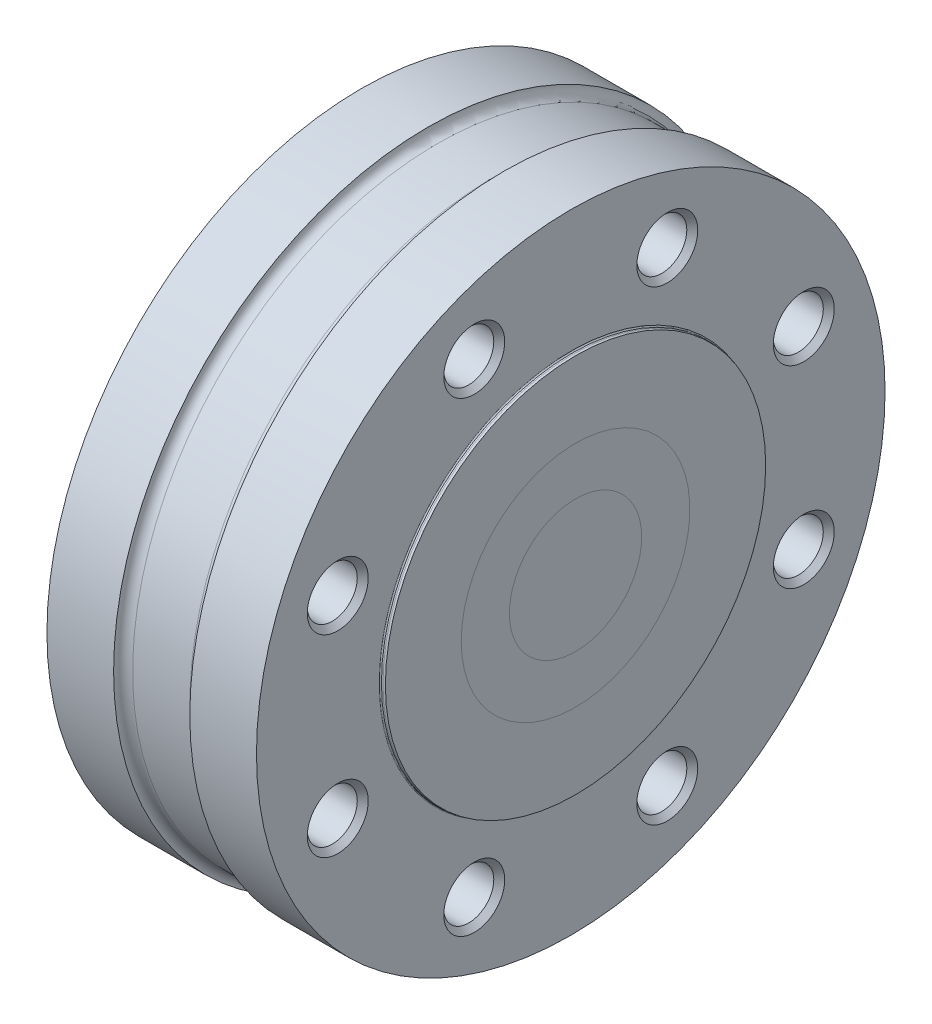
ISO-10303-21;
HEADER;
FILE_DESCRIPTION(('STEP AP214'),'2;1');
FILE_NAME('part.step','',(''),(''),'','','');
FILE_SCHEMA(('AUTOMOTIVE_DESIGN { 1 0 10303 214 1 1 1 1 }'));
ENDSEC;
DATA;
#1=APPLICATION_CONTEXT('core data for automotive mechanical design processes');
#2=APPLICATION_PROTOCOL_DEFINITION('international standard','automotive_design',2000,#1);
#3=PRODUCT_CONTEXT('',#1,'mechanical');
#4=PRODUCT('Part','Part','',(#3));
#5=PRODUCT_RELATED_PRODUCT_CATEGORY('part','',(#4));
#6=PRODUCT_DEFINITION_FORMATION('','',#4);
#7=PRODUCT_DEFINITION_CONTEXT('part definition',#1,'design');
#8=PRODUCT_DEFINITION('design','',#6,#7);
#9=PRODUCT_DEFINITION_SHAPE('','',#8);
#10=(LENGTH_UNIT() NAMED_UNIT(*) SI_UNIT(.MILLI.,.METRE.));
#11=(NAMED_UNIT(*) PLANE_ANGLE_UNIT() SI_UNIT($,.RADIAN.));
#12=(NAMED_UNIT(*) SI_UNIT($,.STERADIAN.) SOLID_ANGLE_UNIT());
#13=UNCERTAINTY_MEASURE_WITH_UNIT(LENGTH_MEASURE(1.E-05),#10,'distance_accuracy_value','');
#14=(GEOMETRIC_REPRESENTATION_CONTEXT(3) GLOBAL_UNCERTAINTY_ASSIGNED_CONTEXT((#13)) GLOBAL_UNIT_ASSIGNED_CONTEXT((#10,
#11,#12)) REPRESENTATION_CONTEXT('',''));
#15=CARTESIAN_POINT('',(0.,0.,0.));
#16=DIRECTION('',(0.,0.,1.));
#17=DIRECTION('',(1.,0.,0.));
#18=AXIS2_PLACEMENT_3D('',#15,#16,#17);
#19=CARTESIAN_POINT('',(-1.58749999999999,0.,0.));
#20=DIRECTION('',(1.,0.,0.));
#21=DIRECTION('',(0.,0.,-1.));
#22=AXIS2_PLACEMENT_3D('',#19,#20,#21);
#23=PLANE('',#22);
#24=CARTESIAN_POINT('',(-1.58749999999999,0.,0.));
#25=DIRECTION('',(1.,0.,0.));
#26=DIRECTION('',(0.,0.,-1.));
#27=AXIS2_PLACEMENT_3D('',#24,#25,#26);
#28=CIRCLE('',#27,22.0515028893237);
#29=CARTESIAN_POINT('',(-1.58749999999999,0.,-22.0515028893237));
#30=VERTEX_POINT('',#29);
#31=EDGE_CURVE('E10',#30,#30,#28,.F.);
#32=ORIENTED_EDGE('',*,*,#31,.F.);
#33=EDGE_LOOP('',(#32));
#34=FACE_BOUND('',#33,.T.);
#35=ADVANCED_FACE('F14',(#34),#23,.T.);
#36=ORIENTED_EDGE('',*,*,#31,.T.);
#37=EDGE_LOOP('',(#36));
#38=FACE_BOUND('',#37,.T.);
#39=CARTESIAN_POINT('',(-1.5875,0.,0.));
#40=DIRECTION('',(-1.,0.,0.));
#41=DIRECTION('',(0.,0.,1.));
#42=AXIS2_PLACEMENT_3D('',#39,#40,#41);
#43=CIRCLE('',#42,38.1113438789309);
#44=CARTESIAN_POINT('',(-1.5875,0.,38.1113438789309));
#45=VERTEX_POINT('',#44);
#46=EDGE_CURVE('E22',#45,#45,#43,.F.);
#47=ORIENTED_EDGE('',*,*,#46,.T.);
#48=EDGE_LOOP('',(#47));
#49=FACE_BOUND('',#48,.T.);
#50=ADVANCED_FACE('F16',(#38,#49),#23,.T.);
#51=CARTESIAN_POINT('',(-74.6125,14.29385,0.));
#52=DIRECTION('',(1.,0.,0.));
#53=DIRECTION('',(0.,0.,-1.));
#54=AXIS2_PLACEMENT_3D('',#51,#52,#53);
#55=PLANE('',#54);
#56=CARTESIAN_POINT('',(-74.6125,0.,0.));
#57=DIRECTION('',(-1.,0.,0.));
#58=DIRECTION('',(0.,0.,1.));
#59=AXIS2_PLACEMENT_3D('',#56,#57,#58);
#60=CIRCLE('',#59,38.1);
#61=CARTESIAN_POINT('',(-74.6125,0.,38.1));
#62=VERTEX_POINT('',#61);
#63=EDGE_CURVE('E97',#62,#62,#60,.T.);
#64=ORIENTED_EDGE('',*,*,#63,.F.);
#65=EDGE_LOOP('',(#64));
#66=FACE_BOUND('',#65,.T.);
#67=CARTESIAN_POINT('',(-74.6125,0.,0.));
#68=DIRECTION('',(1.,0.,0.));
#69=DIRECTION('',(0.,0.,-1.));
#70=AXIS2_PLACEMENT_3D('',#67,#68,#69);
#71=CIRCLE('',#70,38.2093296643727);
#72=CARTESIAN_POINT('',(-74.6125,0.,-38.2093296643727));
#73=VERTEX_POINT('',#72);
#74=EDGE_CURVE('E31',#73,#73,#71,.T.);
#75=ORIENTED_EDGE('',*,*,#74,.F.);
#76=EDGE_LOOP('',(#75));
#77=FACE_BOUND('',#76,.T.);
#78=ADVANCED_FACE('F275',(#66,#77),#55,.F.);
#79=CARTESIAN_POINT('',(-2.286,0.,0.));
#80=DIRECTION('',(1.,0.,0.));
#81=DIRECTION('',(0.,0.,-1.));
#82=AXIS2_PLACEMENT_3D('',#79,#80,#81);
#83=TOROIDAL_SURFACE('',#82,61.214,2.286);
#84=CARTESIAN_POINT('',(-1.5875,0.,0.));
#85=DIRECTION('',(-1.,0.,0.));
#86=DIRECTION('',(0.,0.,1.));
#87=AXIS2_PLACEMENT_3D('',#84,#85,#86);
#88=CIRCLE('',#87,63.3906703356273);
#89=CARTESIAN_POINT('',(-1.5875,0.,63.3906703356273));
#90=VERTEX_POINT('',#89);
#91=EDGE_CURVE('E43',#90,#90,#88,.F.);
#92=ORIENTED_EDGE('',*,*,#91,.F.);
#93=EDGE_LOOP('',(#92));
#94=FACE_BOUND('',#93,.T.);
#95=CARTESIAN_POINT('',(-2.28600000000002,0.,0.));
#96=DIRECTION('',(1.,0.,0.));
#97=DIRECTION('',(0.,0.,-1.));
#98=AXIS2_PLACEMENT_3D('',#95,#96,#97);
#99=CIRCLE('',#98,63.5);
#100=CARTESIAN_POINT('',(-2.28600000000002,0.,-63.5));
#101=VERTEX_POINT('',#100);
#102=EDGE_CURVE('E40',#101,#101,#99,.T.);
#103=ORIENTED_EDGE('',*,*,#102,.T.);
#104=EDGE_LOOP('',(#103));
#105=FACE_BOUND('',#104,.T.);
#106=ADVANCED_FACE('F279',(#94,#105),#83,.T.);
#107=CARTESIAN_POINT('',(0.,0.,0.));
#108=DIRECTION('',(1.,0.,0.));
#109=DIRECTION('',(0.,0.,-1.));
#110=AXIS2_PLACEMENT_3D('',#107,#108,#109);
#111=CYLINDRICAL_SURFACE('',#110,63.5);
#112=CARTESIAN_POINT('',(-2.794,0.,0.));
#113=DIRECTION('',(1.,0.,0.));
#114=DIRECTION('',(0.,0.,-1.));
#115=AXIS2_PLACEMENT_3D('',#112,#113,#114);
#116=CIRCLE('',#115,63.5);
#117=CARTESIAN_POINT('',(-2.794,0.,-63.5));
#118=VERTEX_POINT('',#117);
#119=EDGE_CURVE('E55',#118,#118,#116,.T.);
#120=ORIENTED_EDGE('',*,*,#119,.T.);
#121=EDGE_LOOP('',(#120));
#122=FACE_BOUND('',#121,.T.);
#123=ORIENTED_EDGE('',*,*,#102,.F.);
#124=EDGE_LOOP('',(#123));
#125=FACE_BOUND('',#124,.T.);
#126=ADVANCED_FACE('F286',(#122,#125),#111,.T.);
#127=CARTESIAN_POINT('',(-2.794,0.,0.));
#128=DIRECTION('',(1.,0.,0.));
#129=DIRECTION('',(0.,0.,-1.));
#130=AXIS2_PLACEMENT_3D('',#127,#128,#129);
#131=TOROIDAL_SURFACE('',#130,63.881,0.381000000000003);
#132=CARTESIAN_POINT('',(-3.175,0.,0.));
#133=DIRECTION('',(1.,0.,0.));
#134=DIRECTION('',(0.,0.,-1.));
#135=AXIS2_PLACEMENT_3D('',#132,#133,#134);
#136=CIRCLE('',#135,63.881);
#137=CARTESIAN_POINT('',(-3.175,0.,-63.881));
#138=VERTEX_POINT('',#137);
#139=EDGE_CURVE('E59',#138,#138,#136,.T.);
#140=ORIENTED_EDGE('',*,*,#139,.T.);
#141=EDGE_LOOP('',(#140));
#142=FACE_BOUND('',#141,.T.);
#143=ORIENTED_EDGE('',*,*,#119,.F.);
#144=EDGE_LOOP('',(#143));
#145=FACE_BOUND('',#144,.T.);
#146=ADVANCED_FACE('F238',(#142,#145),#131,.F.);
#147=CARTESIAN_POINT('',(-3.175,63.881,0.));
#148=DIRECTION('',(1.,0.,0.));
#149=DIRECTION('',(0.,0.,-1.));
#150=AXIS2_PLACEMENT_3D('',#147,#148,#149);
#151=PLANE('',#150);
#152=CARTESIAN_POINT('',(-3.175,32.1737268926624,-77.674247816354));
#153=DIRECTION('',(1.,0.,0.));
#154=DIRECTION('',(0.,0.,-1.));
#155=AXIS2_PLACEMENT_3D('',#152,#153,#154);
#156=CIRCLE('',#155,10.16);
#157=CARTESIAN_POINT('',(-3.175,32.1737268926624,-87.834247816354));
#158=VERTEX_POINT('',#157);
#159=EDGE_CURVE('E156',#158,#158,#156,.T.);
#160=ORIENTED_EDGE('',*,*,#159,.F.);
#161=EDGE_LOOP('',(#160));
#162=FACE_BOUND('',#161,.T.);
#163=CARTESIAN_POINT('',(-3.175,-32.1737268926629,-77.6742478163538));
#164=DIRECTION('',(1.,0.,0.));
#165=DIRECTION('',(0.,0.,-1.));
#166=AXIS2_PLACEMENT_3D('',#163,#164,#165);
#167=CIRCLE('',#166,10.16);
#168=CARTESIAN_POINT('',(-3.175,-32.1737268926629,-87.8342478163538));
#169=VERTEX_POINT('',#168);
#170=EDGE_CURVE('E140',#169,#169,#167,.T.);
#171=ORIENTED_EDGE('',*,*,#170,.F.);
#172=EDGE_LOOP('',(#171));
#173=FACE_BOUND('',#172,.T.);
#174=CARTESIAN_POINT('',(-3.175,-77.6742478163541,-32.1737268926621));
#175=DIRECTION('',(1.,0.,0.));
#176=DIRECTION('',(0.,0.,-1.));
#177=AXIS2_PLACEMENT_3D('',#174,#175,#176);
#178=CIRCLE('',#177,10.16);
#179=CARTESIAN_POINT('',(-3.175,-77.6742478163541,-42.3337268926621));
#180=VERTEX_POINT('',#179);
#181=EDGE_CURVE('E122',#180,#180,#178,.T.);
#182=ORIENTED_EDGE('',*,*,#181,.F.);
#183=EDGE_LOOP('',(#182));
#184=FACE_BOUND('',#183,.T.);
#185=CARTESIAN_POINT('',(-3.175,-77.6742478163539,32.1737268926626));
#186=DIRECTION('',(1.,0.,0.));
#187=DIRECTION('',(0.,0.,-1.));
#188=AXIS2_PLACEMENT_3D('',#185,#186,#187);
#189=CIRCLE('',#188,10.16);
#190=CARTESIAN_POINT('',(-3.175,-77.6742478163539,22.0137268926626));
#191=VERTEX_POINT('',#190);
#192=EDGE_CURVE('E131',#191,#191,#189,.T.);
#193=ORIENTED_EDGE('',*,*,#192,.F.);
#194=EDGE_LOOP('',(#193));
#195=FACE_BOUND('',#194,.T.);
#196=CARTESIAN_POINT('',(-3.175,-32.1737268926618,77.6742478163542));
#197=DIRECTION('',(1.,0.,0.));
#198=DIRECTION('',(0.,0.,-1.));
#199=AXIS2_PLACEMENT_3D('',#196,#197,#198);
#200=CIRCLE('',#199,10.16);
#201=CARTESIAN_POINT('',(-3.175,-32.1737268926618,67.5142478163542));
#202=VERTEX_POINT('',#201);
#203=EDGE_CURVE('E203',#202,#202,#200,.T.);
#204=ORIENTED_EDGE('',*,*,#203,.F.);
#205=EDGE_LOOP('',(#204));
#206=FACE_BOUND('',#205,.T.);
#207=CARTESIAN_POINT('',(-3.175,32.1737268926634,77.6742478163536));
#208=DIRECTION('',(1.,0.,0.));
#209=DIRECTION('',(0.,0.,-1.));
#210=AXIS2_PLACEMENT_3D('',#207,#208,#209);
#211=CIRCLE('',#210,10.16);
#212=CARTESIAN_POINT('',(-3.175,32.1737268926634,67.5142478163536));
#213=VERTEX_POINT('',#212);
#214=EDGE_CURVE('E186',#213,#213,#211,.T.);
#215=ORIENTED_EDGE('',*,*,#214,.F.);
#216=EDGE_LOOP('',(#215));
#217=FACE_BOUND('',#216,.T.);
#218=CARTESIAN_POINT('',(-3.175,77.6742478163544,32.1737268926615));
#219=DIRECTION('',(1.,0.,0.));
#220=DIRECTION('',(0.,0.,-1.));
#221=AXIS2_PLACEMENT_3D('',#218,#219,#220);
#222=CIRCLE('',#221,10.16);
#223=CARTESIAN_POINT('',(-3.175,77.6742478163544,22.0137268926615));
#224=VERTEX_POINT('',#223);
#225=EDGE_CURVE('E195',#224,#224,#222,.T.);
#226=ORIENTED_EDGE('',*,*,#225,.F.);
#227=EDGE_LOOP('',(#226));
#228=FACE_BOUND('',#227,.T.);
#229=CARTESIAN_POINT('',(-3.175,77.6742478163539,-32.1737268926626));
#230=DIRECTION('',(1.,0.,0.));
#231=DIRECTION('',(0.,0.,-1.));
#232=AXIS2_PLACEMENT_3D('',#229,#230,#231);
#233=CIRCLE('',#232,10.16);
#234=CARTESIAN_POINT('',(-3.175,77.6742478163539,-42.3337268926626));
#235=VERTEX_POINT('',#234);
#236=EDGE_CURVE('E113',#235,#235,#233,.T.);
#237=ORIENTED_EDGE('',*,*,#236,.F.);
#238=EDGE_LOOP('',(#237));
#239=FACE_BOUND('',#238,.T.);
#240=ORIENTED_EDGE('',*,*,#139,.F.);
#241=EDGE_LOOP('',(#240));
#242=FACE_BOUND('',#241,.T.);
#243=CARTESIAN_POINT('',(-3.175,0.,0.));
#244=DIRECTION('',(-1.,0.,0.));
#245=DIRECTION('',(0.,0.,1.));
#246=AXIS2_PLACEMENT_3D('',#243,#244,#245);
#247=CIRCLE('',#246,104.775);
#248=CARTESIAN_POINT('',(-3.175,0.,104.775));
#249=VERTEX_POINT('',#248);
#250=EDGE_CURVE('E85',#249,#249,#247,.T.);
#251=ORIENTED_EDGE('',*,*,#250,.F.);
#252=EDGE_LOOP('',(#251));
#253=FACE_BOUND('',#252,.T.);
#254=ADVANCED_FACE('F234',(#162,#173,#184,#195,#206,#217,#228,#239,#242,#253),#151,.T.);
#255=CARTESIAN_POINT('',(-73.025,69.85,0.));
#256=DIRECTION('',(-1.,0.,0.));
#257=DIRECTION('',(0.,0.,1.));
#258=AXIS2_PLACEMENT_3D('',#255,#256,#257);
#259=PLANE('',#258);
#260=CARTESIAN_POINT('',(-73.025,32.1737268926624,-77.674247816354));
#261=DIRECTION('',(-1.,0.,0.));
#262=DIRECTION('',(0.,0.,1.));
#263=AXIS2_PLACEMENT_3D('',#260,#261,#262);
#264=CIRCLE('',#263,10.16);
#265=CARTESIAN_POINT('',(-73.025,32.1737268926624,-67.514247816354));
#266=VERTEX_POINT('',#265);
#267=EDGE_CURVE('E175',#266,#266,#264,.T.);
#268=ORIENTED_EDGE('',*,*,#267,.F.);
#269=EDGE_LOOP('',(#268));
#270=FACE_BOUND('',#269,.T.);
#271=CARTESIAN_POINT('',(-73.025,-32.1737268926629,-77.6742478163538));
#272=DIRECTION('',(-1.,0.,0.));
#273=DIRECTION('',(0.,0.,1.));
#274=AXIS2_PLACEMENT_3D('',#271,#272,#273);
#275=CIRCLE('',#274,10.16);
#276=CARTESIAN_POINT('',(-73.025,-32.1737268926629,-67.5142478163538));
#277=VERTEX_POINT('',#276);
#278=EDGE_CURVE('E161',#277,#277,#275,.T.);
#279=ORIENTED_EDGE('',*,*,#278,.F.);
#280=EDGE_LOOP('',(#279));
#281=FACE_BOUND('',#280,.T.);
#282=CARTESIAN_POINT('',(-73.025,-77.6742478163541,-32.1737268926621));
#283=DIRECTION('',(-1.,0.,0.));
#284=DIRECTION('',(0.,0.,1.));
#285=AXIS2_PLACEMENT_3D('',#282,#283,#284);
#286=CIRCLE('',#285,10.16);
#287=CARTESIAN_POINT('',(-73.025,-77.6742478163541,-22.0137268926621));
#288=VERTEX_POINT('',#287);
#289=EDGE_CURVE('E145',#288,#288,#286,.T.);
#290=ORIENTED_EDGE('',*,*,#289,.F.);
#291=EDGE_LOOP('',(#290));
#292=FACE_BOUND('',#291,.T.);
#293=CARTESIAN_POINT('',(-73.025,-77.6742478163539,32.1737268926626));
#294=DIRECTION('',(-1.,0.,0.));
#295=DIRECTION('',(0.,0.,1.));
#296=AXIS2_PLACEMENT_3D('',#293,#294,#295);
#297=CIRCLE('',#296,10.16);
#298=CARTESIAN_POINT('',(-73.025,-77.6742478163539,42.3337268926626));
#299=VERTEX_POINT('',#298);
#300=EDGE_CURVE('E127',#299,#299,#297,.T.);
#301=ORIENTED_EDGE('',*,*,#300,.F.);
#302=EDGE_LOOP('',(#301));
#303=FACE_BOUND('',#302,.T.);
#304=CARTESIAN_POINT('',(-73.025,-32.1737268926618,77.6742478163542));
#305=DIRECTION('',(-1.,0.,0.));
#306=DIRECTION('',(0.,0.,1.));
#307=AXIS2_PLACEMENT_3D('',#304,#305,#306);
#308=CIRCLE('',#307,10.16);
#309=CARTESIAN_POINT('',(-73.025,-32.1737268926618,87.8342478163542));
#310=VERTEX_POINT('',#309);
#311=EDGE_CURVE('E222',#310,#310,#308,.T.);
#312=ORIENTED_EDGE('',*,*,#311,.F.);
#313=EDGE_LOOP('',(#312));
#314=FACE_BOUND('',#313,.T.);
#315=CARTESIAN_POINT('',(-73.025,32.1737268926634,77.6742478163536));
#316=DIRECTION('',(-1.,0.,0.));
#317=DIRECTION('',(0.,0.,1.));
#318=AXIS2_PLACEMENT_3D('',#315,#316,#317);
#319=CIRCLE('',#318,10.16);
#320=CARTESIAN_POINT('',(-73.025,32.1737268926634,87.8342478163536));
#321=VERTEX_POINT('',#320);
#322=EDGE_CURVE('E208',#321,#321,#319,.T.);
#323=ORIENTED_EDGE('',*,*,#322,.F.);
#324=EDGE_LOOP('',(#323));
#325=FACE_BOUND('',#324,.T.);
#326=CARTESIAN_POINT('',(-73.025,77.6742478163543,32.1737268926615));
#327=DIRECTION('',(-1.,0.,0.));
#328=DIRECTION('',(0.,0.,1.));
#329=AXIS2_PLACEMENT_3D('',#326,#327,#328);
#330=CIRCLE('',#329,10.16);
#331=CARTESIAN_POINT('',(-73.025,77.6742478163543,42.3337268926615));
#332=VERTEX_POINT('',#331);
#333=EDGE_CURVE('E191',#332,#332,#330,.T.);
#334=ORIENTED_EDGE('',*,*,#333,.F.);
#335=EDGE_LOOP('',(#334));
#336=FACE_BOUND('',#335,.T.);
#337=CARTESIAN_POINT('',(-73.025,77.6742478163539,-32.1737268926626));
#338=DIRECTION('',(-1.,0.,0.));
#339=DIRECTION('',(0.,0.,1.));
#340=AXIS2_PLACEMENT_3D('',#337,#338,#339);
#341=CIRCLE('',#340,10.16);
#342=CARTESIAN_POINT('',(-73.025,77.6742478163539,-22.0137268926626));
#343=VERTEX_POINT('',#342);
#344=EDGE_CURVE('E109',#343,#343,#341,.T.);
#345=ORIENTED_EDGE('',*,*,#344,.F.);
#346=EDGE_LOOP('',(#345));
#347=FACE_BOUND('',#346,.T.);
#348=CARTESIAN_POINT('',(-73.025,0.,0.));
#349=DIRECTION('',(1.,0.,0.));
#350=DIRECTION('',(0.,0.,-1.));
#351=AXIS2_PLACEMENT_3D('',#348,#349,#350);
#352=CIRCLE('',#351,63.881);
#353=CARTESIAN_POINT('',(-73.025,0.,-63.881));
#354=VERTEX_POINT('',#353);
#355=EDGE_CURVE('E63',#354,#354,#352,.T.);
#356=ORIENTED_EDGE('',*,*,#355,.T.);
#357=EDGE_LOOP('',(#356));
#358=FACE_BOUND('',#357,.T.);
#359=CARTESIAN_POINT('',(-73.025,0.,0.));
#360=DIRECTION('',(1.,0.,0.));
#361=DIRECTION('',(0.,0.,-1.));
#362=AXIS2_PLACEMENT_3D('',#359,#360,#361);
#363=CIRCLE('',#362,104.775);
#364=CARTESIAN_POINT('',(-73.025,0.,-104.775));
#365=VERTEX_POINT('',#364);
#366=EDGE_CURVE('E52',#365,#365,#363,.T.);
#367=ORIENTED_EDGE('',*,*,#366,.F.);
#368=EDGE_LOOP('',(#367));
#369=FACE_BOUND('',#368,.T.);
#370=ADVANCED_FACE('F237',(#270,#281,#292,#303,#314,#325,#336,#347,#358,#369),#259,.T.);
#371=CARTESIAN_POINT('',(-73.406,0.,0.));
#372=DIRECTION('',(1.,0.,0.));
#373=DIRECTION('',(0.,0.,-1.));
#374=AXIS2_PLACEMENT_3D('',#371,#372,#373);
#375=TOROIDAL_SURFACE('',#374,63.881,0.381000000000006);
#376=CARTESIAN_POINT('',(-73.406,0.,0.));
#377=DIRECTION('',(1.,0.,0.));
#378=DIRECTION('',(0.,0.,-1.));
#379=AXIS2_PLACEMENT_3D('',#376,#377,#378);
#380=CIRCLE('',#379,63.5);
#381=CARTESIAN_POINT('',(-73.406,0.,-63.5));
#382=VERTEX_POINT('',#381);
#383=EDGE_CURVE('E67',#382,#382,#380,.T.);
#384=ORIENTED_EDGE('',*,*,#383,.T.);
#385=EDGE_LOOP('',(#384));
#386=FACE_BOUND('',#385,.T.);
#387=ORIENTED_EDGE('',*,*,#355,.F.);
#388=EDGE_LOOP('',(#387));
#389=FACE_BOUND('',#388,.T.);
#390=ADVANCED_FACE('F310',(#386,#389),#375,.F.);
#391=CARTESIAN_POINT('',(0.,0.,0.));
#392=DIRECTION('',(1.,0.,0.));
#393=DIRECTION('',(0.,0.,-1.));
#394=AXIS2_PLACEMENT_3D('',#391,#392,#393);
#395=CYLINDRICAL_SURFACE('',#394,63.5);
#396=CARTESIAN_POINT('',(-73.914,0.,0.));
#397=DIRECTION('',(1.,0.,0.));
#398=DIRECTION('',(0.,0.,-1.));
#399=AXIS2_PLACEMENT_3D('',#396,#397,#398);
#400=CIRCLE('',#399,63.5);
#401=CARTESIAN_POINT('',(-73.914,0.,-63.5));
#402=VERTEX_POINT('',#401);
#403=EDGE_CURVE('E71',#402,#402,#400,.T.);
#404=ORIENTED_EDGE('',*,*,#403,.T.);
#405=EDGE_LOOP('',(#404));
#406=FACE_BOUND('',#405,.T.);
#407=ORIENTED_EDGE('',*,*,#383,.F.);
#408=EDGE_LOOP('',(#407));
#409=FACE_BOUND('',#408,.T.);
#410=ADVANCED_FACE('F299',(#406,#409),#395,.T.);
#411=CARTESIAN_POINT('',(-73.914,0.,0.));
#412=DIRECTION('',(1.,0.,0.));
#413=DIRECTION('',(0.,0.,-1.));
#414=AXIS2_PLACEMENT_3D('',#411,#412,#413);
#415=TOROIDAL_SURFACE('',#414,61.214,2.286);
#416=CARTESIAN_POINT('',(-74.6125,0.,0.));
#417=DIRECTION('',(1.,0.,0.));
#418=DIRECTION('',(0.,0.,-1.));
#419=AXIS2_PLACEMENT_3D('',#416,#417,#418);
#420=CIRCLE('',#419,63.3906703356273);
#421=CARTESIAN_POINT('',(-74.6125,0.,-63.3906703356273));
#422=VERTEX_POINT('',#421);
#423=EDGE_CURVE('E48',#422,#422,#420,.F.);
#424=ORIENTED_EDGE('',*,*,#423,.F.);
#425=EDGE_LOOP('',(#424));
#426=FACE_BOUND('',#425,.T.);
#427=ORIENTED_EDGE('',*,*,#403,.F.);
#428=EDGE_LOOP('',(#427));
#429=FACE_BOUND('',#428,.T.);
#430=ADVANCED_FACE('F292',(#426,#429),#415,.T.);
#431=ORIENTED_EDGE('',*,*,#74,.T.);
#432=EDGE_LOOP('',(#431));
#433=FACE_BOUND('',#432,.T.);
#434=ORIENTED_EDGE('',*,*,#423,.T.);
#435=EDGE_LOOP('',(#434));
#436=FACE_BOUND('',#435,.T.);
#437=ADVANCED_FACE('F282',(#433,#436),#55,.F.);
#438=CARTESIAN_POINT('',(-1.5875,114.509348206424,0.));
#439=DIRECTION('',(-1.,0.,0.));
#440=DIRECTION('',(0.,0.,1.));
#441=AXIS2_PLACEMENT_3D('',#438,#439,#440);
#442=PLANE('',#441);
#443=ORIENTED_EDGE('',*,*,#46,.F.);
#444=EDGE_LOOP('',(#443));
#445=FACE_BOUND('',#444,.T.);
#446=ORIENTED_EDGE('',*,*,#91,.T.);
#447=EDGE_LOOP('',(#446));
#448=FACE_BOUND('',#447,.T.);
#449=ADVANCED_FACE('F265',(#445,#448),#442,.F.);
#450=CARTESIAN_POINT('',(-84.2733553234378,0.,0.));
#451=DIRECTION('',(-1.,0.,0.));
#452=DIRECTION('',(0.,0.,1.));
#453=AXIS2_PLACEMENT_3D('',#450,#451,#452);
#454=CYLINDRICAL_SURFACE('',#453,104.775);
#455=CARTESIAN_POINT('',(-50.8,0.,0.));
#456=DIRECTION('',(1.,0.,0.));
#457=DIRECTION('',(0.,0.,-1.));
#458=AXIS2_PLACEMENT_3D('',#455,#456,#457);
#459=CIRCLE('',#458,104.775);
#460=CARTESIAN_POINT('',(-50.8,0.,-104.775));
#461=VERTEX_POINT('',#460);
#462=EDGE_CURVE('E93',#461,#461,#459,.T.);
#463=ORIENTED_EDGE('',*,*,#462,.F.);
#464=EDGE_LOOP('',(#463));
#465=FACE_BOUND('',#464,.T.);
#466=ORIENTED_EDGE('',*,*,#366,.T.);
#467=EDGE_LOOP('',(#466));
#468=FACE_BOUND('',#467,.T.);
#469=ADVANCED_FACE('F254',(#465,#468),#454,.T.);
#470=CARTESIAN_POINT('',(-25.4,0.,0.));
#471=DIRECTION('',(-1.,0.,0.));
#472=DIRECTION('',(0.,0.,1.));
#473=AXIS2_PLACEMENT_3D('',#470,#471,#472);
#474=CIRCLE('',#473,104.775);
#475=CARTESIAN_POINT('',(-25.4,0.,104.775));
#476=VERTEX_POINT('',#475);
#477=EDGE_CURVE('E89',#476,#476,#474,.T.);
#478=ORIENTED_EDGE('',*,*,#477,.F.);
#479=EDGE_LOOP('',(#478));
#480=FACE_BOUND('',#479,.T.);
#481=ORIENTED_EDGE('',*,*,#250,.T.);
#482=EDGE_LOOP('',(#481));
#483=FACE_BOUND('',#482,.T.);
#484=ADVANCED_FACE('F251',(#480,#483),#454,.T.);
#485=CARTESIAN_POINT('',(-28.575,0.,0.));
#486=DIRECTION('',(1.,0.,0.));
#487=DIRECTION('',(0.,0.,-1.));
#488=AXIS2_PLACEMENT_3D('',#485,#486,#487);
#489=TOROIDAL_SURFACE('',#488,104.775,3.17499999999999);
#490=CARTESIAN_POINT('',(-28.575,0.,0.));
#491=DIRECTION('',(1.,0.,0.));
#492=DIRECTION('',(0.,0.,-1.));
#493=AXIS2_PLACEMENT_3D('',#490,#491,#492);
#494=CIRCLE('',#493,101.6);
#495=CARTESIAN_POINT('',(-28.575,0.,-101.6));
#496=VERTEX_POINT('',#495);
#497=EDGE_CURVE('E75',#496,#496,#494,.T.);
#498=ORIENTED_EDGE('',*,*,#497,.T.);
#499=EDGE_LOOP('',(#498));
#500=FACE_BOUND('',#499,.T.);
#501=ORIENTED_EDGE('',*,*,#477,.T.);
#502=EDGE_LOOP('',(#501));
#503=FACE_BOUND('',#502,.T.);
#504=ADVANCED_FACE('F253',(#500,#503),#489,.F.);
#505=CARTESIAN_POINT('',(0.,0.,0.));
#506=DIRECTION('',(1.,0.,0.));
#507=DIRECTION('',(0.,0.,-1.));
#508=AXIS2_PLACEMENT_3D('',#505,#506,#507);
#509=CYLINDRICAL_SURFACE('',#508,101.6);
#510=CARTESIAN_POINT('',(-47.625,0.,0.));
#511=DIRECTION('',(1.,0.,0.));
#512=DIRECTION('',(0.,0.,-1.));
#513=AXIS2_PLACEMENT_3D('',#510,#511,#512);
#514=CIRCLE('',#513,101.6);
#515=CARTESIAN_POINT('',(-47.625,0.,-101.6));
#516=VERTEX_POINT('',#515);
#517=EDGE_CURVE('E47',#516,#516,#514,.T.);
#518=ORIENTED_EDGE('',*,*,#517,.T.);
#519=EDGE_LOOP('',(#518));
#520=FACE_BOUND('',#519,.T.);
#521=ORIENTED_EDGE('',*,*,#497,.F.);
#522=EDGE_LOOP('',(#521));
#523=FACE_BOUND('',#522,.T.);
#524=ADVANCED_FACE('F262',(#520,#523),#509,.T.);
#525=CARTESIAN_POINT('',(-47.625,0.,0.));
#526=DIRECTION('',(1.,0.,0.));
#527=DIRECTION('',(0.,0.,-1.));
#528=AXIS2_PLACEMENT_3D('',#525,#526,#527);
#529=TOROIDAL_SURFACE('',#528,104.775,3.175);
#530=ORIENTED_EDGE('',*,*,#462,.T.);
#531=EDGE_LOOP('',(#530));
#532=FACE_BOUND('',#531,.T.);
#533=ORIENTED_EDGE('',*,*,#517,.F.);
#534=EDGE_LOOP('',(#533));
#535=FACE_BOUND('',#534,.T.);
#536=ADVANCED_FACE('F412',(#532,#535),#529,.F.);
#537=CARTESIAN_POINT('',(-74.6125,0.,0.));
#538=DIRECTION('',(-1.,0.,0.));
#539=DIRECTION('',(0.,0.,1.));
#540=AXIS2_PLACEMENT_3D('',#537,#538,#539);
#541=PLANE('',#540);
#542=ORIENTED_EDGE('',*,*,#63,.T.);
#543=EDGE_LOOP('',(#542));
#544=FACE_BOUND('',#543,.T.);
#545=ADVANCED_FACE('F458',(#544),#541,.T.);
#546=CARTESIAN_POINT('',(-73.025,77.6742478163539,-32.1737268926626));
#547=DIRECTION('',(-1.,0.,0.));
#548=DIRECTION('',(0.,0.,1.));
#549=AXIS2_PLACEMENT_3D('',#546,#547,#548);
#550=CONICAL_SURFACE('',#549,10.16,0.785398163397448);
#551=CARTESIAN_POINT('',(-71.19874,77.6742478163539,-32.1737268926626));
#552=DIRECTION('',(-1.,0.,0.));
#553=DIRECTION('',(0.,0.,1.));
#554=AXIS2_PLACEMENT_3D('',#551,#552,#553);
#555=CIRCLE('',#554,8.33373999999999);
#556=CARTESIAN_POINT('',(-71.19874,77.6742478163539,-23.8399868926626));
#557=VERTEX_POINT('',#556);
#558=EDGE_CURVE('E101',#557,#557,#555,.T.);
#559=ORIENTED_EDGE('',*,*,#558,.F.);
#560=EDGE_LOOP('',(#559));
#561=FACE_BOUND('',#560,.T.);
#562=ORIENTED_EDGE('',*,*,#344,.T.);
#563=EDGE_LOOP('',(#562));
#564=FACE_BOUND('',#563,.T.);
#565=ADVANCED_FACE('F487',(#561,#564),#550,.F.);
#566=CARTESIAN_POINT('',(-3.175,77.6742478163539,-32.1737268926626));
#567=DIRECTION('',(1.,0.,0.));
#568=DIRECTION('',(0.,0.,-1.));
#569=AXIS2_PLACEMENT_3D('',#566,#567,#568);
#570=CONICAL_SURFACE('',#569,10.16,0.785398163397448);
#571=CARTESIAN_POINT('',(-5.00126000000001,77.6742478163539,-32.1737268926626));
#572=DIRECTION('',(1.,0.,0.));
#573=DIRECTION('',(0.,0.,-1.));
#574=AXIS2_PLACEMENT_3D('',#571,#572,#573);
#575=CIRCLE('',#574,8.33373999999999);
#576=CARTESIAN_POINT('',(-5.00126000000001,77.6742478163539,-40.5074668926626));
#577=VERTEX_POINT('',#576);
#578=EDGE_CURVE('E105',#577,#577,#575,.T.);
#579=ORIENTED_EDGE('',*,*,#578,.F.);
#580=EDGE_LOOP('',(#579));
#581=FACE_BOUND('',#580,.T.);
#582=ORIENTED_EDGE('',*,*,#236,.T.);
#583=EDGE_LOOP('',(#582));
#584=FACE_BOUND('',#583,.T.);
#585=ADVANCED_FACE('F525',(#581,#584),#570,.F.);
#586=CARTESIAN_POINT('',(-3.175,77.6742478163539,-32.1737268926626));
#587=DIRECTION('',(1.,0.,0.));
#588=DIRECTION('',(0.,0.,-1.));
#589=AXIS2_PLACEMENT_3D('',#586,#587,#588);
#590=CYLINDRICAL_SURFACE('',#589,8.33373999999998);
#591=ORIENTED_EDGE('',*,*,#578,.T.);
#592=EDGE_LOOP('',(#591));
#593=FACE_BOUND('',#592,.T.);
#594=ORIENTED_EDGE('',*,*,#558,.T.);
#595=EDGE_LOOP('',(#594));
#596=FACE_BOUND('',#595,.T.);
#597=ADVANCED_FACE('F734',(#593,#596),#590,.F.);
#598=CARTESIAN_POINT('',(-73.025,77.6742478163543,32.1737268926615));
#599=DIRECTION('',(-1.,0.,0.));
#600=DIRECTION('',(0.,0.,1.));
#601=AXIS2_PLACEMENT_3D('',#598,#599,#600);
#602=CONICAL_SURFACE('',#601,10.16,0.785398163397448);
#603=CARTESIAN_POINT('',(-71.19874,77.6742478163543,32.1737268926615));
#604=DIRECTION('',(-1.,0.,0.));
#605=DIRECTION('',(0.,0.,1.));
#606=AXIS2_PLACEMENT_3D('',#603,#604,#605);
#607=CIRCLE('',#606,8.33373999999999);
#608=CARTESIAN_POINT('',(-71.19874,77.6742478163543,40.5074668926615));
#609=VERTEX_POINT('',#608);
#610=EDGE_CURVE('E182',#609,#609,#607,.T.);
#611=ORIENTED_EDGE('',*,*,#610,.F.);
#612=EDGE_LOOP('',(#611));
#613=FACE_BOUND('',#612,.T.);
#614=ORIENTED_EDGE('',*,*,#333,.T.);
#615=EDGE_LOOP('',(#614));
#616=FACE_BOUND('',#615,.T.);
#617=ADVANCED_FACE('F730',(#613,#616),#602,.F.);
#618=CARTESIAN_POINT('',(-3.175,77.6742478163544,32.1737268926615));
#619=DIRECTION('',(1.,0.,0.));
#620=DIRECTION('',(0.,0.,-1.));
#621=AXIS2_PLACEMENT_3D('',#618,#619,#620);
#622=CONICAL_SURFACE('',#621,10.16,0.785398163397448);
#623=CARTESIAN_POINT('',(-5.00126000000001,77.6742478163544,32.1737268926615));
#624=DIRECTION('',(1.,0.,0.));
#625=DIRECTION('',(0.,0.,-1.));
#626=AXIS2_PLACEMENT_3D('',#623,#624,#625);
#627=CIRCLE('',#626,8.33373999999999);
#628=CARTESIAN_POINT('',(-5.00126000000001,77.6742478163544,23.8399868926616));
#629=VERTEX_POINT('',#628);
#630=EDGE_CURVE('E187',#629,#629,#627,.T.);
#631=ORIENTED_EDGE('',*,*,#630,.F.);
#632=EDGE_LOOP('',(#631));
#633=FACE_BOUND('',#632,.T.);
#634=ORIENTED_EDGE('',*,*,#225,.T.);
#635=EDGE_LOOP('',(#634));
#636=FACE_BOUND('',#635,.T.);
#637=ADVANCED_FACE('F727',(#633,#636),#622,.F.);
#638=CARTESIAN_POINT('',(-3.175,77.6742478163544,32.1737268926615));
#639=DIRECTION('',(1.,0.,0.));
#640=DIRECTION('',(0.,0.,-1.));
#641=AXIS2_PLACEMENT_3D('',#638,#639,#640);
#642=CYLINDRICAL_SURFACE('',#641,8.33373999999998);
#643=ORIENTED_EDGE('',*,*,#630,.T.);
#644=EDGE_LOOP('',(#643));
#645=FACE_BOUND('',#644,.T.);
#646=ORIENTED_EDGE('',*,*,#610,.T.);
#647=EDGE_LOOP('',(#646));
#648=FACE_BOUND('',#647,.T.);
#649=ADVANCED_FACE('F709',(#645,#648),#642,.F.);
#650=CARTESIAN_POINT('',(-73.025,32.1737268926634,77.6742478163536));
#651=DIRECTION('',(-1.,0.,0.));
#652=DIRECTION('',(0.,0.,1.));
#653=AXIS2_PLACEMENT_3D('',#650,#651,#652);
#654=CONICAL_SURFACE('',#653,10.16,0.78539816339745);
#655=CARTESIAN_POINT('',(-71.19874,32.1737268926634,77.6742478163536));
#656=DIRECTION('',(-1.,0.,0.));
#657=DIRECTION('',(0.,0.,1.));
#658=AXIS2_PLACEMENT_3D('',#655,#656,#657);
#659=CIRCLE('',#658,8.33373999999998);
#660=CARTESIAN_POINT('',(-71.19874,32.1737268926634,86.0079878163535));
#661=VERTEX_POINT('',#660);
#662=EDGE_CURVE('E199',#661,#661,#659,.T.);
#663=ORIENTED_EDGE('',*,*,#662,.F.);
#664=EDGE_LOOP('',(#663));
#665=FACE_BOUND('',#664,.T.);
#666=ORIENTED_EDGE('',*,*,#322,.T.);
#667=EDGE_LOOP('',(#666));
#668=FACE_BOUND('',#667,.T.);
#669=ADVANCED_FACE('F705',(#665,#668),#654,.F.);
#670=CARTESIAN_POINT('',(-3.175,32.1737268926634,77.6742478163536));
#671=DIRECTION('',(1.,0.,0.));
#672=DIRECTION('',(0.,0.,-1.));
#673=AXIS2_PLACEMENT_3D('',#670,#671,#672);
#674=CONICAL_SURFACE('',#673,10.16,0.785398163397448);
#675=CARTESIAN_POINT('',(-5.00126000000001,32.1737268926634,77.6742478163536));
#676=DIRECTION('',(1.,0.,0.));
#677=DIRECTION('',(0.,0.,-1.));
#678=AXIS2_PLACEMENT_3D('',#675,#676,#677);
#679=CIRCLE('',#678,8.33373999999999);
#680=CARTESIAN_POINT('',(-5.00126000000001,32.1737268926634,69.3405078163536));
#681=VERTEX_POINT('',#680);
#682=EDGE_CURVE('E204',#681,#681,#679,.T.);
#683=ORIENTED_EDGE('',*,*,#682,.F.);
#684=EDGE_LOOP('',(#683));
#685=FACE_BOUND('',#684,.T.);
#686=ORIENTED_EDGE('',*,*,#214,.T.);
#687=EDGE_LOOP('',(#686));
#688=FACE_BOUND('',#687,.T.);
#689=ADVANCED_FACE('F399',(#685,#688),#674,.F.);
#690=CARTESIAN_POINT('',(-3.175,32.1737268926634,77.6742478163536));
#691=DIRECTION('',(1.,0.,0.));
#692=DIRECTION('',(0.,0.,-1.));
#693=AXIS2_PLACEMENT_3D('',#690,#691,#692);
#694=CYLINDRICAL_SURFACE('',#693,8.33373999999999);
#695=ORIENTED_EDGE('',*,*,#682,.T.);
#696=EDGE_LOOP('',(#695));
#697=FACE_BOUND('',#696,.T.);
#698=ORIENTED_EDGE('',*,*,#662,.T.);
#699=EDGE_LOOP('',(#698));
#700=FACE_BOUND('',#699,.T.);
#701=ADVANCED_FACE('F393',(#697,#700),#694,.F.);
#702=CARTESIAN_POINT('',(-73.025,-32.1737268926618,77.6742478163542));
#703=DIRECTION('',(-1.,0.,0.));
#704=DIRECTION('',(0.,0.,1.));
#705=AXIS2_PLACEMENT_3D('',#702,#703,#704);
#706=CONICAL_SURFACE('',#705,10.16,0.78539816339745);
#707=CARTESIAN_POINT('',(-71.19874,-32.1737268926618,77.6742478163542));
#708=DIRECTION('',(-1.,0.,0.));
#709=DIRECTION('',(0.,0.,1.));
#710=AXIS2_PLACEMENT_3D('',#707,#708,#709);
#711=CIRCLE('',#710,8.33373999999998);
#712=CARTESIAN_POINT('',(-71.19874,-32.1737268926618,86.0079878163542));
#713=VERTEX_POINT('',#712);
#714=EDGE_CURVE('E135',#713,#713,#711,.T.);
#715=ORIENTED_EDGE('',*,*,#714,.F.);
#716=EDGE_LOOP('',(#715));
#717=FACE_BOUND('',#716,.T.);
#718=ORIENTED_EDGE('',*,*,#311,.T.);
#719=EDGE_LOOP('',(#718));
#720=FACE_BOUND('',#719,.T.);
#721=ADVANCED_FACE('F398',(#717,#720),#706,.F.);
#722=CARTESIAN_POINT('',(-3.175,-32.1737268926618,77.6742478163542));
#723=DIRECTION('',(1.,0.,0.));
#724=DIRECTION('',(0.,0.,-1.));
#725=AXIS2_PLACEMENT_3D('',#722,#723,#724);
#726=CONICAL_SURFACE('',#725,10.16,0.785398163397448);
#727=CARTESIAN_POINT('',(-5.00126000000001,-32.1737268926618,77.6742478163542));
#728=DIRECTION('',(1.,0.,0.));
#729=DIRECTION('',(0.,0.,-1.));
#730=AXIS2_PLACEMENT_3D('',#727,#728,#729);
#731=CIRCLE('',#730,8.33373999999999);
#732=CARTESIAN_POINT('',(-5.00126000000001,-32.1737268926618,69.3405078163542));
#733=VERTEX_POINT('',#732);
#734=EDGE_CURVE('E218',#733,#733,#731,.T.);
#735=ORIENTED_EDGE('',*,*,#734,.F.);
#736=EDGE_LOOP('',(#735));
#737=FACE_BOUND('',#736,.T.);
#738=ORIENTED_EDGE('',*,*,#203,.T.);
#739=EDGE_LOOP('',(#738));
#740=FACE_BOUND('',#739,.T.);
#741=ADVANCED_FACE('F232',(#737,#740),#726,.F.);
#742=CARTESIAN_POINT('',(-3.175,-32.1737268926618,77.6742478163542));
#743=DIRECTION('',(1.,0.,0.));
#744=DIRECTION('',(0.,0.,-1.));
#745=AXIS2_PLACEMENT_3D('',#742,#743,#744);
#746=CYLINDRICAL_SURFACE('',#745,8.33373999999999);
#747=ORIENTED_EDGE('',*,*,#734,.T.);
#748=EDGE_LOOP('',(#747));
#749=FACE_BOUND('',#748,.T.);
#750=ORIENTED_EDGE('',*,*,#714,.T.);
#751=EDGE_LOOP('',(#750));
#752=FACE_BOUND('',#751,.T.);
#753=ADVANCED_FACE('F477',(#749,#752),#746,.F.);
#754=CARTESIAN_POINT('',(-73.025,-77.6742478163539,32.1737268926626));
#755=DIRECTION('',(-1.,0.,0.));
#756=DIRECTION('',(0.,0.,1.));
#757=AXIS2_PLACEMENT_3D('',#754,#755,#756);
#758=CONICAL_SURFACE('',#757,10.16,0.785398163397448);
#759=CARTESIAN_POINT('',(-71.19874,-77.6742478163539,32.1737268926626));
#760=DIRECTION('',(-1.,0.,0.));
#761=DIRECTION('',(0.,0.,1.));
#762=AXIS2_PLACEMENT_3D('',#759,#760,#761);
#763=CIRCLE('',#762,8.33373999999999);
#764=CARTESIAN_POINT('',(-71.19874,-77.6742478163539,40.5074668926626));
#765=VERTEX_POINT('',#764);
#766=EDGE_CURVE('E118',#765,#765,#763,.T.);
#767=ORIENTED_EDGE('',*,*,#766,.F.);
#768=EDGE_LOOP('',(#767));
#769=FACE_BOUND('',#768,.T.);
#770=ORIENTED_EDGE('',*,*,#300,.T.);
#771=EDGE_LOOP('',(#770));
#772=FACE_BOUND('',#771,.T.);
#773=ADVANCED_FACE('F579',(#769,#772),#758,.F.);
#774=CARTESIAN_POINT('',(-3.175,-77.6742478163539,32.1737268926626));
#775=DIRECTION('',(1.,0.,0.));
#776=DIRECTION('',(0.,0.,-1.));
#777=AXIS2_PLACEMENT_3D('',#774,#775,#776);
#778=CONICAL_SURFACE('',#777,10.16,0.785398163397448);
#779=CARTESIAN_POINT('',(-5.00126000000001,-77.6742478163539,32.1737268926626));
#780=DIRECTION('',(1.,0.,0.));
#781=DIRECTION('',(0.,0.,-1.));
#782=AXIS2_PLACEMENT_3D('',#779,#780,#781);
#783=CIRCLE('',#782,8.33373999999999);
#784=CARTESIAN_POINT('',(-5.00126000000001,-77.6742478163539,23.8399868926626));
#785=VERTEX_POINT('',#784);
#786=EDGE_CURVE('E123',#785,#785,#783,.T.);
#787=ORIENTED_EDGE('',*,*,#786,.F.);
#788=EDGE_LOOP('',(#787));
#789=FACE_BOUND('',#788,.T.);
#790=ORIENTED_EDGE('',*,*,#192,.T.);
#791=EDGE_LOOP('',(#790));
#792=FACE_BOUND('',#791,.T.);
#793=ADVANCED_FACE('F585',(#789,#792),#778,.F.);
#794=CARTESIAN_POINT('',(-3.175,-77.6742478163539,32.1737268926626));
#795=DIRECTION('',(1.,0.,0.));
#796=DIRECTION('',(0.,0.,-1.));
#797=AXIS2_PLACEMENT_3D('',#794,#795,#796);
#798=CYLINDRICAL_SURFACE('',#797,8.33373999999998);
#799=ORIENTED_EDGE('',*,*,#786,.T.);
#800=EDGE_LOOP('',(#799));
#801=FACE_BOUND('',#800,.T.);
#802=ORIENTED_EDGE('',*,*,#766,.T.);
#803=EDGE_LOOP('',(#802));
#804=FACE_BOUND('',#803,.T.);
#805=ADVANCED_FACE('F600',(#801,#804),#798,.F.);
#806=CARTESIAN_POINT('',(-73.025,-77.6742478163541,-32.1737268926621));
#807=DIRECTION('',(-1.,0.,0.));
#808=DIRECTION('',(0.,0.,1.));
#809=AXIS2_PLACEMENT_3D('',#806,#807,#808);
#810=CONICAL_SURFACE('',#809,10.16,0.785398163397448);
#811=CARTESIAN_POINT('',(-71.19874,-77.6742478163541,-32.1737268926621));
#812=DIRECTION('',(-1.,0.,0.));
#813=DIRECTION('',(0.,0.,1.));
#814=AXIS2_PLACEMENT_3D('',#811,#812,#813);
#815=CIRCLE('',#814,8.33373999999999);
#816=CARTESIAN_POINT('',(-71.19874,-77.6742478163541,-23.8399868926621));
#817=VERTEX_POINT('',#816);
#818=EDGE_CURVE('E136',#817,#817,#815,.T.);
#819=ORIENTED_EDGE('',*,*,#818,.F.);
#820=EDGE_LOOP('',(#819));
#821=FACE_BOUND('',#820,.T.);
#822=ORIENTED_EDGE('',*,*,#289,.T.);
#823=EDGE_LOOP('',(#822));
#824=FACE_BOUND('',#823,.T.);
#825=ADVANCED_FACE('F610',(#821,#824),#810,.F.);
#826=CARTESIAN_POINT('',(-3.175,-77.6742478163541,-32.1737268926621));
#827=DIRECTION('',(1.,0.,0.));
#828=DIRECTION('',(0.,0.,-1.));
#829=AXIS2_PLACEMENT_3D('',#826,#827,#828);
#830=CONICAL_SURFACE('',#829,10.16,0.785398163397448);
#831=CARTESIAN_POINT('',(-5.00126000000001,-77.6742478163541,-32.1737268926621));
#832=DIRECTION('',(1.,0.,0.));
#833=DIRECTION('',(0.,0.,-1.));
#834=AXIS2_PLACEMENT_3D('',#831,#832,#833);
#835=CIRCLE('',#834,8.33373999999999);
#836=CARTESIAN_POINT('',(-5.00126000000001,-77.6742478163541,-40.5074668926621));
#837=VERTEX_POINT('',#836);
#838=EDGE_CURVE('E141',#837,#837,#835,.T.);
#839=ORIENTED_EDGE('',*,*,#838,.F.);
#840=EDGE_LOOP('',(#839));
#841=FACE_BOUND('',#840,.T.);
#842=ORIENTED_EDGE('',*,*,#181,.T.);
#843=EDGE_LOOP('',(#842));
#844=FACE_BOUND('',#843,.T.);
#845=ADVANCED_FACE('F745',(#841,#844),#830,.F.);
#846=CARTESIAN_POINT('',(-3.175,-77.6742478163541,-32.1737268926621));
#847=DIRECTION('',(1.,0.,0.));
#848=DIRECTION('',(0.,0.,-1.));
#849=AXIS2_PLACEMENT_3D('',#846,#847,#848);
#850=CYLINDRICAL_SURFACE('',#849,8.33373999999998);
#851=ORIENTED_EDGE('',*,*,#838,.T.);
#852=EDGE_LOOP('',(#851));
#853=FACE_BOUND('',#852,.T.);
#854=ORIENTED_EDGE('',*,*,#818,.T.);
#855=EDGE_LOOP('',(#854));
#856=FACE_BOUND('',#855,.T.);
#857=ADVANCED_FACE('F741',(#853,#856),#850,.F.);
#858=CARTESIAN_POINT('',(-73.025,-32.1737268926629,-77.6742478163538));
#859=DIRECTION('',(-1.,0.,0.));
#860=DIRECTION('',(0.,0.,1.));
#861=AXIS2_PLACEMENT_3D('',#858,#859,#860);
#862=CONICAL_SURFACE('',#861,10.16,0.78539816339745);
#863=CARTESIAN_POINT('',(-71.19874,-32.1737268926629,-77.6742478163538));
#864=DIRECTION('',(-1.,0.,0.));
#865=DIRECTION('',(0.,0.,1.));
#866=AXIS2_PLACEMENT_3D('',#863,#864,#865);
#867=CIRCLE('',#866,8.33373999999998);
#868=CARTESIAN_POINT('',(-71.19874,-32.1737268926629,-69.3405078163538));
#869=VERTEX_POINT('',#868);
#870=EDGE_CURVE('E152',#869,#869,#867,.T.);
#871=ORIENTED_EDGE('',*,*,#870,.F.);
#872=EDGE_LOOP('',(#871));
#873=FACE_BOUND('',#872,.T.);
#874=ORIENTED_EDGE('',*,*,#278,.T.);
#875=EDGE_LOOP('',(#874));
#876=FACE_BOUND('',#875,.T.);
#877=ADVANCED_FACE('F383',(#873,#876),#862,.F.);
#878=CARTESIAN_POINT('',(-3.175,-32.1737268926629,-77.6742478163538));
#879=DIRECTION('',(1.,0.,0.));
#880=DIRECTION('',(0.,0.,-1.));
#881=AXIS2_PLACEMENT_3D('',#878,#879,#880);
#882=CONICAL_SURFACE('',#881,10.16,0.785398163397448);
#883=CARTESIAN_POINT('',(-5.00126000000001,-32.1737268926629,-77.6742478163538));
#884=DIRECTION('',(1.,0.,0.));
#885=DIRECTION('',(0.,0.,-1.));
#886=AXIS2_PLACEMENT_3D('',#883,#884,#885);
#887=CIRCLE('',#886,8.33373999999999);
#888=CARTESIAN_POINT('',(-5.00126000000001,-32.1737268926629,-86.0079878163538));
#889=VERTEX_POINT('',#888);
#890=EDGE_CURVE('E157',#889,#889,#887,.T.);
#891=ORIENTED_EDGE('',*,*,#890,.F.);
#892=EDGE_LOOP('',(#891));
#893=FACE_BOUND('',#892,.T.);
#894=ORIENTED_EDGE('',*,*,#170,.T.);
#895=EDGE_LOOP('',(#894));
#896=FACE_BOUND('',#895,.T.);
#897=ADVANCED_FACE('F377',(#893,#896),#882,.F.);
#898=CARTESIAN_POINT('',(-3.175,-32.1737268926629,-77.6742478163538));
#899=DIRECTION('',(1.,0.,0.));
#900=DIRECTION('',(0.,0.,-1.));
#901=AXIS2_PLACEMENT_3D('',#898,#899,#900);
#902=CYLINDRICAL_SURFACE('',#901,8.33373999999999);
#903=ORIENTED_EDGE('',*,*,#890,.T.);
#904=EDGE_LOOP('',(#903));
#905=FACE_BOUND('',#904,.T.);
#906=ORIENTED_EDGE('',*,*,#870,.T.);
#907=EDGE_LOOP('',(#906));
#908=FACE_BOUND('',#907,.T.);
#909=ADVANCED_FACE('F382',(#905,#908),#902,.F.);
#910=CARTESIAN_POINT('',(-73.025,32.1737268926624,-77.674247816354));
#911=DIRECTION('',(-1.,0.,0.));
#912=DIRECTION('',(0.,0.,1.));
#913=AXIS2_PLACEMENT_3D('',#910,#911,#912);
#914=CONICAL_SURFACE('',#913,10.16,0.78539816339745);
#915=CARTESIAN_POINT('',(-71.19874,32.1737268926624,-77.674247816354));
#916=DIRECTION('',(-1.,0.,0.));
#917=DIRECTION('',(0.,0.,1.));
#918=AXIS2_PLACEMENT_3D('',#915,#916,#917);
#919=CIRCLE('',#918,8.33373999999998);
#920=CARTESIAN_POINT('',(-71.19874,32.1737268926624,-69.340507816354));
#921=VERTEX_POINT('',#920);
#922=EDGE_CURVE('E117',#921,#921,#919,.T.);
#923=ORIENTED_EDGE('',*,*,#922,.F.);
#924=EDGE_LOOP('',(#923));
#925=FACE_BOUND('',#924,.T.);
#926=ORIENTED_EDGE('',*,*,#267,.T.);
#927=EDGE_LOOP('',(#926));
#928=FACE_BOUND('',#927,.T.);
#929=ADVANCED_FACE('F439',(#925,#928),#914,.F.);
#930=CARTESIAN_POINT('',(-3.175,32.1737268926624,-77.674247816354));
#931=DIRECTION('',(1.,0.,0.));
#932=DIRECTION('',(0.,0.,-1.));
#933=AXIS2_PLACEMENT_3D('',#930,#931,#932);
#934=CONICAL_SURFACE('',#933,10.16,0.785398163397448);
#935=CARTESIAN_POINT('',(-5.00126000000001,32.1737268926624,-77.674247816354));
#936=DIRECTION('',(1.,0.,0.));
#937=DIRECTION('',(0.,0.,-1.));
#938=AXIS2_PLACEMENT_3D('',#935,#936,#937);
#939=CIRCLE('',#938,8.33373999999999);
#940=CARTESIAN_POINT('',(-5.00126000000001,32.1737268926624,-86.007987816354));
#941=VERTEX_POINT('',#940);
#942=EDGE_CURVE('E171',#941,#941,#939,.T.);
#943=ORIENTED_EDGE('',*,*,#942,.F.);
#944=EDGE_LOOP('',(#943));
#945=FACE_BOUND('',#944,.T.);
#946=ORIENTED_EDGE('',*,*,#159,.T.);
#947=EDGE_LOOP('',(#946));
#948=FACE_BOUND('',#947,.T.);
#949=ADVANCED_FACE('F669',(#945,#948),#934,.F.);
#950=CARTESIAN_POINT('',(-3.175,32.1737268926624,-77.674247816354));
#951=DIRECTION('',(1.,0.,0.));
#952=DIRECTION('',(0.,0.,-1.));
#953=AXIS2_PLACEMENT_3D('',#950,#951,#952);
#954=CYLINDRICAL_SURFACE('',#953,8.33373999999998);
#955=ORIENTED_EDGE('',*,*,#942,.T.);
#956=EDGE_LOOP('',(#955));
#957=FACE_BOUND('',#956,.T.);
#958=ORIENTED_EDGE('',*,*,#922,.T.);
#959=EDGE_LOOP('',(#958));
#960=FACE_BOUND('',#959,.T.);
#961=ADVANCED_FACE('F674',(#957,#960),#954,.F.);
#962=CLOSED_SHELL('',(#35,#50,#78,#106,#126,#146,#254,#370,#390,#410,#430,#437,#449,#469,#484,
#504,#524,#536,#545,#565,#585,#597,#617,#637,#649,#669,#689,#701,#721,#741,#753,#773,#793,#805,
#825,#845,#857,#877,#897,#909,#929,#949,#961));
#963=MANIFOLD_SOLID_BREP('B1',#962);
#964=ADVANCED_BREP_SHAPE_REPRESENTATION('',(#18,#963),#14);
#965=SHAPE_DEFINITION_REPRESENTATION(#9,#964);
ENDSEC;
END-ISO-10303-21;
